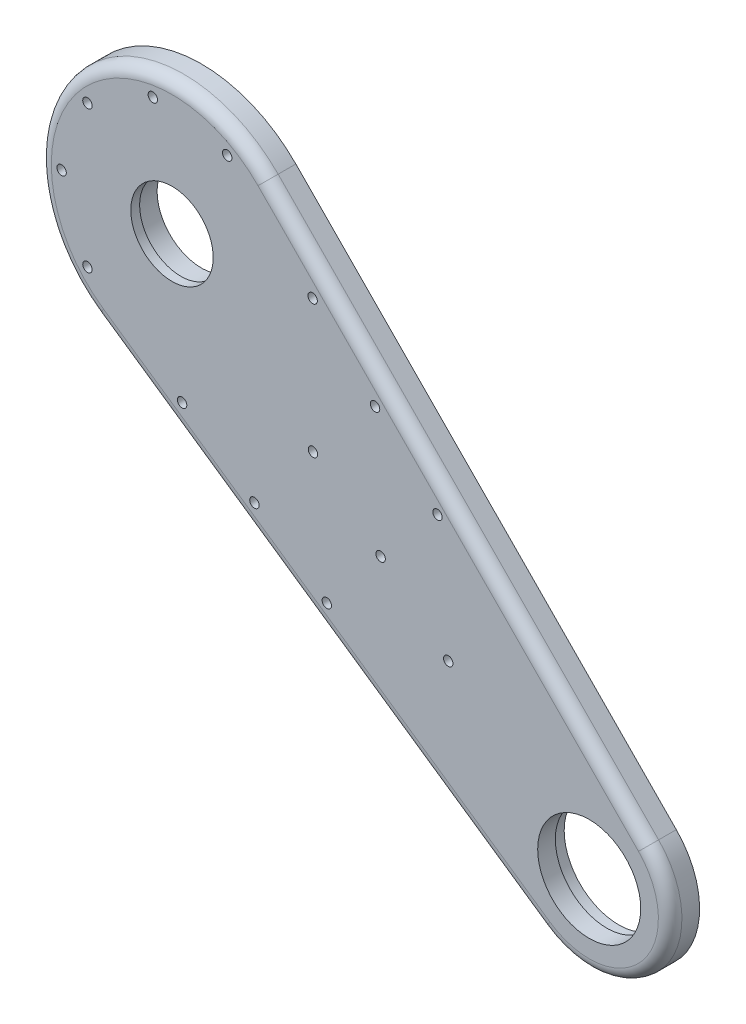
ISO-10303-21;
HEADER;
FILE_DESCRIPTION(('STEP AP214'),'2;1');
FILE_NAME('part.step','',(''),(''),'','','');
FILE_SCHEMA(('AUTOMOTIVE_DESIGN { 1 0 10303 214 1 1 1 1 }'));
ENDSEC;
DATA;
#1=APPLICATION_CONTEXT('core data for automotive mechanical design processes');
#2=APPLICATION_PROTOCOL_DEFINITION('international standard','automotive_design',2000,#1);
#3=PRODUCT_CONTEXT('',#1,'mechanical');
#4=PRODUCT('Part','Part','',(#3));
#5=PRODUCT_RELATED_PRODUCT_CATEGORY('part','',(#4));
#6=PRODUCT_DEFINITION_FORMATION('','',#4);
#7=PRODUCT_DEFINITION_CONTEXT('part definition',#1,'design');
#8=PRODUCT_DEFINITION('design','',#6,#7);
#9=PRODUCT_DEFINITION_SHAPE('','',#8);
#10=(LENGTH_UNIT() NAMED_UNIT(*) SI_UNIT(.MILLI.,.METRE.));
#11=(NAMED_UNIT(*) PLANE_ANGLE_UNIT() SI_UNIT($,.RADIAN.));
#12=(NAMED_UNIT(*) SI_UNIT($,.STERADIAN.) SOLID_ANGLE_UNIT());
#13=UNCERTAINTY_MEASURE_WITH_UNIT(LENGTH_MEASURE(1.E-05),#10,'distance_accuracy_value','');
#14=(GEOMETRIC_REPRESENTATION_CONTEXT(3) GLOBAL_UNCERTAINTY_ASSIGNED_CONTEXT((#13)) GLOBAL_UNIT_ASSIGNED_CONTEXT((#10,
#11,#12)) REPRESENTATION_CONTEXT('',''));
#15=CARTESIAN_POINT('',(0.,0.,0.));
#16=DIRECTION('',(0.,0.,1.));
#17=DIRECTION('',(1.,0.,0.));
#18=AXIS2_PLACEMENT_3D('',#15,#16,#17);
#19=CARTESIAN_POINT('',(0.,0.,47.));
#20=DIRECTION('',(0.,0.,-1.));
#21=DIRECTION('',(-1.,0.,0.));
#22=AXIS2_PLACEMENT_3D('',#19,#20,#21);
#23=CYLINDRICAL_SURFACE('',#22,14.);
#24=CARTESIAN_POINT('',(0.,0.,47.));
#25=DIRECTION('',(0.,0.,-1.));
#26=DIRECTION('',(-1.,0.,0.));
#27=AXIS2_PLACEMENT_3D('',#24,#25,#26);
#28=CIRCLE('',#27,14.);
#29=CARTESIAN_POINT('',(-14.,0.,47.));
#30=VERTEX_POINT('',#29);
#31=EDGE_CURVE('E168',#30,#30,#28,.T.);
#32=ORIENTED_EDGE('',*,*,#31,.F.);
#33=EDGE_LOOP('',(#32));
#34=FACE_BOUND('',#33,.T.);
#35=CARTESIAN_POINT('',(0.,0.,44.));
#36=DIRECTION('',(0.,0.,-1.));
#37=DIRECTION('',(-1.,0.,0.));
#38=AXIS2_PLACEMENT_3D('',#35,#36,#37);
#39=CIRCLE('',#38,14.);
#40=CARTESIAN_POINT('',(-14.,0.,44.));
#41=VERTEX_POINT('',#40);
#42=EDGE_CURVE('E159',#41,#41,#39,.T.);
#43=ORIENTED_EDGE('',*,*,#42,.T.);
#44=EDGE_LOOP('',(#43));
#45=FACE_BOUND('',#44,.T.);
#46=ADVANCED_FACE('F39',(#34,#45),#23,.F.);
#47=CARTESIAN_POINT('',(141.718221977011,-118.91570779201,47.));
#48=DIRECTION('',(0.,0.,-1.));
#49=DIRECTION('',(-1.,0.,0.));
#50=AXIS2_PLACEMENT_3D('',#47,#48,#49);
#51=CYLINDRICAL_SURFACE('',#50,17.5);
#52=CARTESIAN_POINT('',(141.718221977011,-118.91570779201,47.));
#53=DIRECTION('',(0.,0.,1.));
#54=DIRECTION('',(1.,0.,0.));
#55=AXIS2_PLACEMENT_3D('',#52,#53,#54);
#56=CIRCLE('',#55,17.5);
#57=CARTESIAN_POINT('',(159.218221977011,-118.91570779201,47.));
#58=VERTEX_POINT('',#57);
#59=EDGE_CURVE('E245',#58,#58,#56,.T.);
#60=ORIENTED_EDGE('',*,*,#59,.T.);
#61=EDGE_LOOP('',(#60));
#62=FACE_BOUND('',#61,.T.);
#63=CARTESIAN_POINT('',(141.718221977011,-118.91570779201,41.));
#64=DIRECTION('',(0.,0.,-1.));
#65=DIRECTION('',(-1.,0.,0.));
#66=AXIS2_PLACEMENT_3D('',#63,#64,#65);
#67=CIRCLE('',#66,17.5);
#68=CARTESIAN_POINT('',(124.218221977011,-118.91570779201,41.));
#69=VERTEX_POINT('',#68);
#70=EDGE_CURVE('E126',#69,#69,#67,.T.);
#71=ORIENTED_EDGE('',*,*,#70,.T.);
#72=EDGE_LOOP('',(#71));
#73=FACE_BOUND('',#72,.T.);
#74=ADVANCED_FACE('F277',(#62,#73),#51,.F.);
#75=CARTESIAN_POINT('',(0.,0.,47.));
#76=DIRECTION('',(0.,0.,1.));
#77=DIRECTION('',(1.,0.,0.));
#78=AXIS2_PLACEMENT_3D('',#75,#76,#77);
#79=PLANE('',#78);
#80=DIRECTION('',(0.823413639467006,-0.567441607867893,0.));
#81=VECTOR('',#80,1.);
#82=CARTESIAN_POINT('',(128.383344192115,-138.265928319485,47.));
#83=LINE('',#82,#81);
#84=CARTESIAN_POINT('',(-23.2651059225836,-33.7599592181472,47.));
#85=VERTEX_POINT('',#84);
#86=CARTESIAN_POINT('',(128.383344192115,-138.265928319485,47.));
#87=VERTEX_POINT('',#86);
#88=EDGE_CURVE('E134',#85,#87,#83,.T.);
#89=ORIENTED_EDGE('',*,*,#88,.T.);
#90=CARTESIAN_POINT('',(141.718221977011,-118.91570779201,47.));
#91=DIRECTION('',(0.,0.,1.));
#92=DIRECTION('',(1.,0.,0.));
#93=AXIS2_PLACEMENT_3D('',#90,#91,#92);
#94=CIRCLE('',#93,23.5);
#95=CARTESIAN_POINT('',(158.458891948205,-102.423286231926,47.));
#96=VERTEX_POINT('',#95);
#97=EDGE_CURVE('E136',#87,#96,#94,.T.);
#98=ORIENTED_EDGE('',*,*,#97,.T.);
#99=DIRECTION('',(-0.701805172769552,0.712368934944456,0.));
#100=VECTOR('',#99,1.);
#101=CARTESIAN_POINT('',(29.2071263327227,28.7740120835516,47.));
#102=LINE('',#101,#100);
#103=CARTESIAN_POINT('',(29.2071263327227,28.7740120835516,47.));
#104=VERTEX_POINT('',#103);
#105=EDGE_CURVE('E97',#96,#104,#102,.T.);
#106=ORIENTED_EDGE('',*,*,#105,.T.);
#107=CARTESIAN_POINT('',(0.,0.,47.));
#108=DIRECTION('',(0.,0.,1.));
#109=DIRECTION('',(1.,0.,0.));
#110=AXIS2_PLACEMENT_3D('',#107,#108,#109);
#111=CIRCLE('',#110,41.);
#112=EDGE_CURVE('E132',#104,#85,#111,.T.);
#113=ORIENTED_EDGE('',*,*,#112,.T.);
#114=EDGE_LOOP('',(#89,#98,#106,#113));
#115=FACE_BOUND('',#114,.T.);
#116=ORIENTED_EDGE('',*,*,#31,.T.);
#117=EDGE_LOOP('',(#116));
#118=FACE_BOUND('',#117,.T.);
#119=CARTESIAN_POINT('',(18.75,32.4759526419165,47.));
#120=DIRECTION('',(0.,0.,-1.));
#121=DIRECTION('',(-1.,0.,0.));
#122=AXIS2_PLACEMENT_3D('',#119,#120,#121);
#123=CIRCLE('',#122,1.6);
#124=CARTESIAN_POINT('',(17.15,32.4759526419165,47.));
#125=VERTEX_POINT('',#124);
#126=EDGE_CURVE('E172',#125,#125,#123,.T.);
#127=ORIENTED_EDGE('',*,*,#126,.T.);
#128=EDGE_LOOP('',(#127));
#129=FACE_BOUND('',#128,.T.);
#130=CARTESIAN_POINT('',(-6.51180666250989,36.9302907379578,47.));
#131=DIRECTION('',(0.,0.,-1.));
#132=DIRECTION('',(-1.,0.,0.));
#133=AXIS2_PLACEMENT_3D('',#130,#131,#132);
#134=CIRCLE('',#133,1.6);
#135=CARTESIAN_POINT('',(-8.11180666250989,36.9302907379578,47.));
#136=VERTEX_POINT('',#135);
#137=EDGE_CURVE('E182',#136,#136,#134,.T.);
#138=ORIENTED_EDGE('',*,*,#137,.T.);
#139=EDGE_LOOP('',(#138));
#140=FACE_BOUND('',#139,.T.);
#141=CARTESIAN_POINT('',(-28.7266666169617,24.1045353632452,47.));
#142=DIRECTION('',(0.,0.,-1.));
#143=DIRECTION('',(-1.,0.,0.));
#144=AXIS2_PLACEMENT_3D('',#141,#142,#143);
#145=CIRCLE('',#144,1.6);
#146=CARTESIAN_POINT('',(-30.3266666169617,24.1045353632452,47.));
#147=VERTEX_POINT('',#146);
#148=EDGE_CURVE('E188',#147,#147,#145,.T.);
#149=ORIENTED_EDGE('',*,*,#148,.T.);
#150=EDGE_LOOP('',(#149));
#151=FACE_BOUND('',#150,.T.);
#152=CARTESIAN_POINT('',(-37.5,0.,47.));
#153=DIRECTION('',(0.,0.,-1.));
#154=DIRECTION('',(-1.,0.,0.));
#155=AXIS2_PLACEMENT_3D('',#152,#153,#154);
#156=CIRCLE('',#155,1.6);
#157=CARTESIAN_POINT('',(-39.1,0.,47.));
#158=VERTEX_POINT('',#157);
#159=EDGE_CURVE('E194',#158,#158,#156,.T.);
#160=ORIENTED_EDGE('',*,*,#159,.T.);
#161=EDGE_LOOP('',(#160));
#162=FACE_BOUND('',#161,.T.);
#163=CARTESIAN_POINT('',(-28.7266666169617,-24.1045353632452,47.));
#164=DIRECTION('',(0.,0.,-1.));
#165=DIRECTION('',(-1.,0.,0.));
#166=AXIS2_PLACEMENT_3D('',#163,#164,#165);
#167=CIRCLE('',#166,1.6);
#168=CARTESIAN_POINT('',(-30.3266666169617,-24.1045353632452,47.));
#169=VERTEX_POINT('',#168);
#170=EDGE_CURVE('E171',#169,#169,#167,.T.);
#171=ORIENTED_EDGE('',*,*,#170,.T.);
#172=EDGE_LOOP('',(#171));
#173=FACE_BOUND('',#172,.T.);
#174=CARTESIAN_POINT('',(90.1797329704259,-37.4944400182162,47.));
#175=DIRECTION('',(0.,0.,1.));
#176=DIRECTION('',(1.,0.,0.));
#177=AXIS2_PLACEMENT_3D('',#174,#175,#176);
#178=CIRCLE('',#177,1.59999999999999);
#179=CARTESIAN_POINT('',(91.7797329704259,-37.4944400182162,47.));
#180=VERTEX_POINT('',#179);
#181=EDGE_CURVE('E212',#180,#180,#178,.T.);
#182=ORIENTED_EDGE('',*,*,#181,.F.);
#183=EDGE_LOOP('',(#182));
#184=FACE_BOUND('',#183,.T.);
#185=CARTESIAN_POINT('',(28.0038552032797,-65.1000593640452,47.));
#186=DIRECTION('',(0.,0.,1.));
#187=DIRECTION('',(1.,0.,0.));
#188=AXIS2_PLACEMENT_3D('',#185,#186,#187);
#189=CIRCLE('',#188,1.60000000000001);
#190=CARTESIAN_POINT('',(29.6038552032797,-65.1000593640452,47.));
#191=VERTEX_POINT('',#190);
#192=EDGE_CURVE('E224',#191,#191,#189,.T.);
#193=ORIENTED_EDGE('',*,*,#192,.F.);
#194=EDGE_LOOP('',(#193));
#195=FACE_BOUND('',#194,.T.);
#196=CARTESIAN_POINT('',(47.7679902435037,4.94662593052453,47.));
#197=DIRECTION('',(0.,0.,1.));
#198=DIRECTION('',(1.,0.,0.));
#199=AXIS2_PLACEMENT_3D('',#196,#197,#198);
#200=CIRCLE('',#199,1.6);
#201=CARTESIAN_POINT('',(49.3679902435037,4.94662593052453,47.));
#202=VERTEX_POINT('',#201);
#203=EDGE_CURVE('E236',#202,#202,#200,.T.);
#204=ORIENTED_EDGE('',*,*,#203,.F.);
#205=EDGE_LOOP('',(#204));
#206=FACE_BOUND('',#205,.T.);
#207=ORIENTED_EDGE('',*,*,#59,.F.);
#208=EDGE_LOOP('',(#207));
#209=FACE_BOUND('',#208,.T.);
#210=CARTESIAN_POINT('',(70.8591109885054,-59.457853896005,47.));
#211=DIRECTION('',(0.,0.,1.));
#212=DIRECTION('',(1.,0.,0.));
#213=AXIS2_PLACEMENT_3D('',#210,#211,#212);
#214=CIRCLE('',#213,1.60000000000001);
#215=CARTESIAN_POINT('',(72.4591109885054,-59.457853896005,47.));
#216=VERTEX_POINT('',#215);
#217=EDGE_CURVE('E112',#216,#216,#214,.T.);
#218=ORIENTED_EDGE('',*,*,#217,.F.);
#219=EDGE_LOOP('',(#218));
#220=FACE_BOUND('',#219,.T.);
#221=CARTESIAN_POINT('',(47.8777776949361,-40.1742256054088,47.));
#222=DIRECTION('',(0.,0.,1.));
#223=DIRECTION('',(1.,0.,0.));
#224=AXIS2_PLACEMENT_3D('',#221,#222,#223);
#225=CIRCLE('',#224,1.6);
#226=CARTESIAN_POINT('',(49.4777776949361,-40.1742256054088,47.));
#227=VERTEX_POINT('',#226);
#228=EDGE_CURVE('E251',#227,#227,#225,.T.);
#229=ORIENTED_EDGE('',*,*,#228,.F.);
#230=EDGE_LOOP('',(#229));
#231=FACE_BOUND('',#230,.T.);
#232=CARTESIAN_POINT('',(93.8404442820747,-78.7414821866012,47.));
#233=DIRECTION('',(0.,0.,1.));
#234=DIRECTION('',(1.,0.,0.));
#235=AXIS2_PLACEMENT_3D('',#232,#233,#234);
#236=CIRCLE('',#235,1.60000000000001);
#237=CARTESIAN_POINT('',(95.4404442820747,-78.7414821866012,47.));
#238=VERTEX_POINT('',#237);
#239=EDGE_CURVE('E242',#238,#238,#236,.T.);
#240=ORIENTED_EDGE('',*,*,#239,.F.);
#241=EDGE_LOOP('',(#240));
#242=FACE_BOUND('',#241,.T.);
#243=CARTESIAN_POINT('',(3.4233488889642,-47.9012597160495,47.));
#244=DIRECTION('',(0.,0.,1.));
#245=DIRECTION('',(1.,0.,0.));
#246=AXIS2_PLACEMENT_3D('',#243,#244,#245);
#247=CIRCLE('',#246,1.6);
#248=CARTESIAN_POINT('',(5.0233488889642,-47.9012597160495,47.));
#249=VERTEX_POINT('',#248);
#250=EDGE_CURVE('E230',#249,#249,#247,.T.);
#251=ORIENTED_EDGE('',*,*,#250,.F.);
#252=EDGE_LOOP('',(#251));
#253=FACE_BOUND('',#252,.T.);
#254=CARTESIAN_POINT('',(68.9738616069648,-16.2739070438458,47.));
#255=DIRECTION('',(0.,0.,1.));
#256=DIRECTION('',(1.,0.,0.));
#257=AXIS2_PLACEMENT_3D('',#254,#255,#256);
#258=CIRCLE('',#257,1.6);
#259=CARTESIAN_POINT('',(70.5738616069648,-16.2739070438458,47.));
#260=VERTEX_POINT('',#259);
#261=EDGE_CURVE('E218',#260,#260,#258,.T.);
#262=ORIENTED_EDGE('',*,*,#261,.F.);
#263=EDGE_LOOP('',(#262));
#264=FACE_BOUND('',#263,.T.);
#265=CARTESIAN_POINT('',(52.5843615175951,-82.298859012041,47.));
#266=DIRECTION('',(0.,0.,1.));
#267=DIRECTION('',(1.,0.,0.));
#268=AXIS2_PLACEMENT_3D('',#265,#266,#267);
#269=CIRCLE('',#268,1.60000000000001);
#270=CARTESIAN_POINT('',(54.1843615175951,-82.298859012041,47.));
#271=VERTEX_POINT('',#270);
#272=EDGE_CURVE('E206',#271,#271,#269,.T.);
#273=ORIENTED_EDGE('',*,*,#272,.F.);
#274=EDGE_LOOP('',(#273));
#275=FACE_BOUND('',#274,.T.);
#276=ADVANCED_FACE('F285',(#115,#118,#129,#140,#151,#162,#173,#184,#195,#206,#209,#220,#231,
#242,#253,#264,#275),#79,.T.);
#277=CARTESIAN_POINT('',(0.,0.,37.));
#278=DIRECTION('',(0.,0.,1.));
#279=DIRECTION('',(1.,0.,0.));
#280=AXIS2_PLACEMENT_3D('',#277,#278,#279);
#281=PLANE('',#280);
#282=CARTESIAN_POINT('',(0.,0.,37.));
#283=DIRECTION('',(0.,0.,-1.));
#284=DIRECTION('',(-1.,0.,0.));
#285=AXIS2_PLACEMENT_3D('',#282,#283,#284);
#286=CIRCLE('',#285,15.0625);
#287=CARTESIAN_POINT('',(-15.0625,0.,37.));
#288=VERTEX_POINT('',#287);
#289=EDGE_CURVE('E154',#288,#288,#286,.T.);
#290=ORIENTED_EDGE('',*,*,#289,.F.);
#291=EDGE_LOOP('',(#290));
#292=FACE_BOUND('',#291,.T.);
#293=CARTESIAN_POINT('',(18.75,32.4759526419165,37.));
#294=DIRECTION('',(0.,0.,-1.));
#295=DIRECTION('',(-1.,0.,0.));
#296=AXIS2_PLACEMENT_3D('',#293,#294,#295);
#297=CIRCLE('',#296,1.6);
#298=CARTESIAN_POINT('',(17.15,32.4759526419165,37.));
#299=VERTEX_POINT('',#298);
#300=EDGE_CURVE('E176',#299,#299,#297,.T.);
#301=ORIENTED_EDGE('',*,*,#300,.F.);
#302=EDGE_LOOP('',(#301));
#303=FACE_BOUND('',#302,.T.);
#304=CARTESIAN_POINT('',(-6.51180666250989,36.9302907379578,37.));
#305=DIRECTION('',(0.,0.,-1.));
#306=DIRECTION('',(-1.,0.,0.));
#307=AXIS2_PLACEMENT_3D('',#304,#305,#306);
#308=CIRCLE('',#307,1.6);
#309=CARTESIAN_POINT('',(-8.11180666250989,36.9302907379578,37.));
#310=VERTEX_POINT('',#309);
#311=EDGE_CURVE('E179',#310,#310,#308,.T.);
#312=ORIENTED_EDGE('',*,*,#311,.F.);
#313=EDGE_LOOP('',(#312));
#314=FACE_BOUND('',#313,.T.);
#315=CARTESIAN_POINT('',(-28.7266666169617,24.1045353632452,37.));
#316=DIRECTION('',(0.,0.,-1.));
#317=DIRECTION('',(-1.,0.,0.));
#318=AXIS2_PLACEMENT_3D('',#315,#316,#317);
#319=CIRCLE('',#318,1.6);
#320=CARTESIAN_POINT('',(-30.3266666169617,24.1045353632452,37.));
#321=VERTEX_POINT('',#320);
#322=EDGE_CURVE('E185',#321,#321,#319,.T.);
#323=ORIENTED_EDGE('',*,*,#322,.F.);
#324=EDGE_LOOP('',(#323));
#325=FACE_BOUND('',#324,.T.);
#326=CARTESIAN_POINT('',(-37.5,0.,37.));
#327=DIRECTION('',(0.,0.,-1.));
#328=DIRECTION('',(-1.,0.,0.));
#329=AXIS2_PLACEMENT_3D('',#326,#327,#328);
#330=CIRCLE('',#329,1.6);
#331=CARTESIAN_POINT('',(-39.1,0.,37.));
#332=VERTEX_POINT('',#331);
#333=EDGE_CURVE('E191',#332,#332,#330,.T.);
#334=ORIENTED_EDGE('',*,*,#333,.F.);
#335=EDGE_LOOP('',(#334));
#336=FACE_BOUND('',#335,.T.);
#337=CARTESIAN_POINT('',(-28.7266666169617,-24.1045353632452,37.));
#338=DIRECTION('',(0.,0.,-1.));
#339=DIRECTION('',(-1.,0.,0.));
#340=AXIS2_PLACEMENT_3D('',#337,#338,#339);
#341=CIRCLE('',#340,1.6);
#342=CARTESIAN_POINT('',(-30.3266666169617,-24.1045353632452,37.));
#343=VERTEX_POINT('',#342);
#344=EDGE_CURVE('E197',#343,#343,#341,.T.);
#345=ORIENTED_EDGE('',*,*,#344,.F.);
#346=EDGE_LOOP('',(#345));
#347=FACE_BOUND('',#346,.T.);
#348=CARTESIAN_POINT('',(141.718221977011,-118.91570779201,37.));
#349=DIRECTION('',(0.,0.,-1.));
#350=DIRECTION('',(-1.,0.,0.));
#351=AXIS2_PLACEMENT_3D('',#348,#349,#350);
#352=CIRCLE('',#351,18.5);
#353=CARTESIAN_POINT('',(123.218221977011,-118.91570779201,37.));
#354=VERTEX_POINT('',#353);
#355=EDGE_CURVE('E175',#354,#354,#352,.T.);
#356=ORIENTED_EDGE('',*,*,#355,.F.);
#357=EDGE_LOOP('',(#356));
#358=FACE_BOUND('',#357,.T.);
#359=CARTESIAN_POINT('',(0.,0.,37.));
#360=DIRECTION('',(0.,0.,1.));
#361=DIRECTION('',(1.,0.,0.));
#362=AXIS2_PLACEMENT_3D('',#359,#360,#361);
#363=CIRCLE('',#362,45.);
#364=CARTESIAN_POINT('',(32.0566020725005,31.5812327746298,37.));
#365=VERTEX_POINT('',#364);
#366=CARTESIAN_POINT('',(-25.5348723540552,-37.0536137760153,37.));
#367=VERTEX_POINT('',#366);
#368=EDGE_CURVE('E105',#365,#367,#363,.T.);
#369=ORIENTED_EDGE('',*,*,#368,.F.);
#370=DIRECTION('',(-0.701805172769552,0.712368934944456,0.));
#371=VECTOR('',#370,1.);
#372=CARTESIAN_POINT('',(32.0566020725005,31.5812327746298,37.));
#373=LINE('',#372,#371);
#374=CARTESIAN_POINT('',(161.308367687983,-99.6160655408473,37.));
#375=VERTEX_POINT('',#374);
#376=EDGE_CURVE('E120',#375,#365,#373,.T.);
#377=ORIENTED_EDGE('',*,*,#376,.F.);
#378=CARTESIAN_POINT('',(141.718221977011,-118.91570779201,37.));
#379=DIRECTION('',(0.,0.,1.));
#380=DIRECTION('',(1.,0.,0.));
#381=AXIS2_PLACEMENT_3D('',#378,#379,#380);
#382=CIRCLE('',#381,27.5);
#383=CARTESIAN_POINT('',(126.113577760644,-141.559582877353,37.));
#384=VERTEX_POINT('',#383);
#385=EDGE_CURVE('E107',#384,#375,#382,.T.);
#386=ORIENTED_EDGE('',*,*,#385,.F.);
#387=DIRECTION('',(0.823413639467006,-0.567441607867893,0.));
#388=VECTOR('',#387,1.);
#389=CARTESIAN_POINT('',(-25.5348723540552,-37.0536137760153,37.));
#390=LINE('',#389,#388);
#391=EDGE_CURVE('E94',#367,#384,#390,.T.);
#392=ORIENTED_EDGE('',*,*,#391,.F.);
#393=EDGE_LOOP('',(#369,#377,#386,#392));
#394=FACE_BOUND('',#393,.T.);
#395=CARTESIAN_POINT('',(70.8591109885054,-59.457853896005,37.));
#396=DIRECTION('',(0.,0.,1.));
#397=DIRECTION('',(1.,0.,0.));
#398=AXIS2_PLACEMENT_3D('',#395,#396,#397);
#399=CIRCLE('',#398,1.60000000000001);
#400=CARTESIAN_POINT('',(72.4591109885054,-59.457853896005,37.));
#401=VERTEX_POINT('',#400);
#402=EDGE_CURVE('E115',#401,#401,#399,.T.);
#403=ORIENTED_EDGE('',*,*,#402,.T.);
#404=EDGE_LOOP('',(#403));
#405=FACE_BOUND('',#404,.T.);
#406=CARTESIAN_POINT('',(47.8777776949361,-40.1742256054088,37.));
#407=DIRECTION('',(0.,0.,1.));
#408=DIRECTION('',(1.,0.,0.));
#409=AXIS2_PLACEMENT_3D('',#406,#407,#408);
#410=CIRCLE('',#409,1.6);
#411=CARTESIAN_POINT('',(49.4777776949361,-40.1742256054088,37.));
#412=VERTEX_POINT('',#411);
#413=EDGE_CURVE('E250',#412,#412,#410,.T.);
#414=ORIENTED_EDGE('',*,*,#413,.T.);
#415=EDGE_LOOP('',(#414));
#416=FACE_BOUND('',#415,.T.);
#417=CARTESIAN_POINT('',(93.8404442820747,-78.7414821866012,37.));
#418=DIRECTION('',(0.,0.,1.));
#419=DIRECTION('',(1.,0.,0.));
#420=AXIS2_PLACEMENT_3D('',#417,#418,#419);
#421=CIRCLE('',#420,1.60000000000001);
#422=CARTESIAN_POINT('',(95.4404442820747,-78.7414821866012,37.));
#423=VERTEX_POINT('',#422);
#424=EDGE_CURVE('E239',#423,#423,#421,.T.);
#425=ORIENTED_EDGE('',*,*,#424,.T.);
#426=EDGE_LOOP('',(#425));
#427=FACE_BOUND('',#426,.T.);
#428=CARTESIAN_POINT('',(47.7679902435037,4.94662593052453,37.));
#429=DIRECTION('',(0.,0.,1.));
#430=DIRECTION('',(1.,0.,0.));
#431=AXIS2_PLACEMENT_3D('',#428,#429,#430);
#432=CIRCLE('',#431,1.6);
#433=CARTESIAN_POINT('',(49.3679902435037,4.94662593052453,37.));
#434=VERTEX_POINT('',#433);
#435=EDGE_CURVE('E233',#434,#434,#432,.T.);
#436=ORIENTED_EDGE('',*,*,#435,.T.);
#437=EDGE_LOOP('',(#436));
#438=FACE_BOUND('',#437,.T.);
#439=CARTESIAN_POINT('',(3.4233488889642,-47.9012597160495,37.));
#440=DIRECTION('',(0.,0.,1.));
#441=DIRECTION('',(1.,0.,0.));
#442=AXIS2_PLACEMENT_3D('',#439,#440,#441);
#443=CIRCLE('',#442,1.6);
#444=CARTESIAN_POINT('',(5.0233488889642,-47.9012597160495,37.));
#445=VERTEX_POINT('',#444);
#446=EDGE_CURVE('E227',#445,#445,#443,.T.);
#447=ORIENTED_EDGE('',*,*,#446,.T.);
#448=EDGE_LOOP('',(#447));
#449=FACE_BOUND('',#448,.T.);
#450=CARTESIAN_POINT('',(28.0038552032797,-65.1000593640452,37.));
#451=DIRECTION('',(0.,0.,1.));
#452=DIRECTION('',(1.,0.,0.));
#453=AXIS2_PLACEMENT_3D('',#450,#451,#452);
#454=CIRCLE('',#453,1.60000000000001);
#455=CARTESIAN_POINT('',(29.6038552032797,-65.1000593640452,37.));
#456=VERTEX_POINT('',#455);
#457=EDGE_CURVE('E221',#456,#456,#454,.T.);
#458=ORIENTED_EDGE('',*,*,#457,.T.);
#459=EDGE_LOOP('',(#458));
#460=FACE_BOUND('',#459,.T.);
#461=CARTESIAN_POINT('',(68.9738616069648,-16.2739070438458,37.));
#462=DIRECTION('',(0.,0.,1.));
#463=DIRECTION('',(1.,0.,0.));
#464=AXIS2_PLACEMENT_3D('',#461,#462,#463);
#465=CIRCLE('',#464,1.6);
#466=CARTESIAN_POINT('',(70.5738616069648,-16.2739070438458,37.));
#467=VERTEX_POINT('',#466);
#468=EDGE_CURVE('E215',#467,#467,#465,.T.);
#469=ORIENTED_EDGE('',*,*,#468,.T.);
#470=EDGE_LOOP('',(#469));
#471=FACE_BOUND('',#470,.T.);
#472=CARTESIAN_POINT('',(90.1797329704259,-37.4944400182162,37.));
#473=DIRECTION('',(0.,0.,1.));
#474=DIRECTION('',(1.,0.,0.));
#475=AXIS2_PLACEMENT_3D('',#472,#473,#474);
#476=CIRCLE('',#475,1.59999999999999);
#477=CARTESIAN_POINT('',(91.7797329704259,-37.4944400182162,37.));
#478=VERTEX_POINT('',#477);
#479=EDGE_CURVE('E209',#478,#478,#476,.T.);
#480=ORIENTED_EDGE('',*,*,#479,.T.);
#481=EDGE_LOOP('',(#480));
#482=FACE_BOUND('',#481,.T.);
#483=CARTESIAN_POINT('',(52.5843615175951,-82.298859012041,37.));
#484=DIRECTION('',(0.,0.,1.));
#485=DIRECTION('',(1.,0.,0.));
#486=AXIS2_PLACEMENT_3D('',#483,#484,#485);
#487=CIRCLE('',#486,1.60000000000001);
#488=CARTESIAN_POINT('',(54.1843615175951,-82.298859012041,37.));
#489=VERTEX_POINT('',#488);
#490=EDGE_CURVE('E129',#489,#489,#487,.T.);
#491=ORIENTED_EDGE('',*,*,#490,.T.);
#492=EDGE_LOOP('',(#491));
#493=FACE_BOUND('',#492,.T.);
#494=ADVANCED_FACE('F102',(#292,#303,#314,#325,#336,#347,#358,#394,#405,#416,#427,#438,#449,
#460,#471,#482,#493),#281,.F.);
#495=CARTESIAN_POINT('',(0.,0.,47.));
#496=DIRECTION('',(0.,0.,-1.));
#497=DIRECTION('',(-1.,0.,0.));
#498=AXIS2_PLACEMENT_3D('',#495,#496,#497);
#499=CYLINDRICAL_SURFACE('',#498,45.);
#500=DIRECTION('',(0.,0.,-1.));
#501=VECTOR('',#500,1.);
#502=CARTESIAN_POINT('',(-25.5348723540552,-37.0536137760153,47.));
#503=LINE('',#502,#501);
#504=CARTESIAN_POINT('',(-25.5348723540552,-37.0536137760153,43.));
#505=VERTEX_POINT('',#504);
#506=EDGE_CURVE('E91',#505,#367,#503,.T.);
#507=ORIENTED_EDGE('',*,*,#506,.F.);
#508=CARTESIAN_POINT('',(0.,0.,43.));
#509=DIRECTION('',(0.,0.,1.));
#510=DIRECTION('',(1.,0.,0.));
#511=AXIS2_PLACEMENT_3D('',#508,#509,#510);
#512=CIRCLE('',#511,45.);
#513=CARTESIAN_POINT('',(32.0566020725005,31.5812327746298,43.));
#514=VERTEX_POINT('',#513);
#515=EDGE_CURVE('E48',#505,#514,#512,.F.);
#516=ORIENTED_EDGE('',*,*,#515,.T.);
#517=DIRECTION('',(0.,0.,-1.));
#518=VECTOR('',#517,1.);
#519=CARTESIAN_POINT('',(32.0566020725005,31.5812327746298,47.));
#520=LINE('',#519,#518);
#521=EDGE_CURVE('E110',#514,#365,#520,.T.);
#522=ORIENTED_EDGE('',*,*,#521,.T.);
#523=ORIENTED_EDGE('',*,*,#368,.T.);
#524=EDGE_LOOP('',(#507,#516,#522,#523));
#525=FACE_BOUND('',#524,.T.);
#526=ADVANCED_FACE('F109',(#525),#499,.T.);
#527=CARTESIAN_POINT('',(-25.5348723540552,-37.0536137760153,47.));
#528=DIRECTION('',(0.567441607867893,0.823413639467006,0.));
#529=DIRECTION('',(-0.823413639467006,0.567441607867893,0.));
#530=AXIS2_PLACEMENT_3D('',#527,#528,#529);
#531=PLANE('',#530);
#532=DIRECTION('',(0.,0.,-1.));
#533=VECTOR('',#532,1.);
#534=CARTESIAN_POINT('',(126.113577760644,-141.559582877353,47.));
#535=LINE('',#534,#533);
#536=CARTESIAN_POINT('',(126.113577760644,-141.559582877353,43.));
#537=VERTEX_POINT('',#536);
#538=EDGE_CURVE('E98',#537,#384,#535,.T.);
#539=ORIENTED_EDGE('',*,*,#538,.F.);
#540=DIRECTION('',(0.823413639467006,-0.567441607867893,0.));
#541=VECTOR('',#540,1.);
#542=CARTESIAN_POINT('',(-25.5348723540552,-37.0536137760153,43.));
#543=LINE('',#542,#541);
#544=EDGE_CURVE('E63',#537,#505,#543,.F.);
#545=ORIENTED_EDGE('',*,*,#544,.T.);
#546=ORIENTED_EDGE('',*,*,#506,.T.);
#547=ORIENTED_EDGE('',*,*,#391,.T.);
#548=EDGE_LOOP('',(#539,#545,#546,#547));
#549=FACE_BOUND('',#548,.T.);
#550=ADVANCED_FACE('F93',(#549),#531,.F.);
#551=CARTESIAN_POINT('',(141.718221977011,-118.91570779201,47.));
#552=DIRECTION('',(0.,0.,-1.));
#553=DIRECTION('',(-1.,0.,0.));
#554=AXIS2_PLACEMENT_3D('',#551,#552,#553);
#555=CYLINDRICAL_SURFACE('',#554,27.5);
#556=DIRECTION('',(0.,0.,-1.));
#557=VECTOR('',#556,1.);
#558=CARTESIAN_POINT('',(161.308367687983,-99.6160655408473,47.));
#559=LINE('',#558,#557);
#560=CARTESIAN_POINT('',(161.308367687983,-99.6160655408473,43.));
#561=VERTEX_POINT('',#560);
#562=EDGE_CURVE('E123',#561,#375,#559,.T.);
#563=ORIENTED_EDGE('',*,*,#562,.F.);
#564=CARTESIAN_POINT('',(141.718221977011,-118.91570779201,43.));
#565=DIRECTION('',(0.,0.,1.));
#566=DIRECTION('',(1.,0.,0.));
#567=AXIS2_PLACEMENT_3D('',#564,#565,#566);
#568=CIRCLE('',#567,27.5);
#569=EDGE_CURVE('E139',#561,#537,#568,.F.);
#570=ORIENTED_EDGE('',*,*,#569,.T.);
#571=ORIENTED_EDGE('',*,*,#538,.T.);
#572=ORIENTED_EDGE('',*,*,#385,.T.);
#573=EDGE_LOOP('',(#563,#570,#571,#572));
#574=FACE_BOUND('',#573,.T.);
#575=ADVANCED_FACE('F377',(#574),#555,.T.);
#576=CARTESIAN_POINT('',(32.0566020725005,31.5812327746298,47.));
#577=DIRECTION('',(-0.712368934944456,-0.701805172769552,0.));
#578=DIRECTION('',(0.701805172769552,-0.712368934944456,0.));
#579=AXIS2_PLACEMENT_3D('',#576,#577,#578);
#580=PLANE('',#579);
#581=ORIENTED_EDGE('',*,*,#521,.F.);
#582=DIRECTION('',(-0.701805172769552,0.712368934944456,0.));
#583=VECTOR('',#582,1.);
#584=CARTESIAN_POINT('',(161.308367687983,-99.6160655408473,43.));
#585=LINE('',#584,#583);
#586=EDGE_CURVE('E11',#514,#561,#585,.F.);
#587=ORIENTED_EDGE('',*,*,#586,.T.);
#588=ORIENTED_EDGE('',*,*,#562,.T.);
#589=ORIENTED_EDGE('',*,*,#376,.T.);
#590=EDGE_LOOP('',(#581,#587,#588,#589));
#591=FACE_BOUND('',#590,.T.);
#592=ADVANCED_FACE('F272',(#591),#580,.F.);
#593=CARTESIAN_POINT('',(70.8591109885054,-59.457853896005,47.));
#594=DIRECTION('',(0.,0.,-1.));
#595=DIRECTION('',(-1.,0.,0.));
#596=AXIS2_PLACEMENT_3D('',#593,#594,#595);
#597=CYLINDRICAL_SURFACE('',#596,1.60000000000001);
#598=ORIENTED_EDGE('',*,*,#217,.T.);
#599=EDGE_LOOP('',(#598));
#600=FACE_BOUND('',#599,.T.);
#601=ORIENTED_EDGE('',*,*,#402,.F.);
#602=EDGE_LOOP('',(#601));
#603=FACE_BOUND('',#602,.T.);
#604=ADVANCED_FACE('F262',(#600,#603),#597,.F.);
#605=CARTESIAN_POINT('',(47.8777776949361,-40.1742256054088,47.));
#606=DIRECTION('',(0.,0.,-1.));
#607=DIRECTION('',(-1.,0.,0.));
#608=AXIS2_PLACEMENT_3D('',#605,#606,#607);
#609=CYLINDRICAL_SURFACE('',#608,1.6);
#610=ORIENTED_EDGE('',*,*,#228,.T.);
#611=EDGE_LOOP('',(#610));
#612=FACE_BOUND('',#611,.T.);
#613=ORIENTED_EDGE('',*,*,#413,.F.);
#614=EDGE_LOOP('',(#613));
#615=FACE_BOUND('',#614,.T.);
#616=ADVANCED_FACE('F259',(#612,#615),#609,.F.);
#617=CARTESIAN_POINT('',(93.8404442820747,-78.7414821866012,47.));
#618=DIRECTION('',(0.,0.,-1.));
#619=DIRECTION('',(-1.,0.,0.));
#620=AXIS2_PLACEMENT_3D('',#617,#618,#619);
#621=CYLINDRICAL_SURFACE('',#620,1.60000000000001);
#622=ORIENTED_EDGE('',*,*,#239,.T.);
#623=EDGE_LOOP('',(#622));
#624=FACE_BOUND('',#623,.T.);
#625=ORIENTED_EDGE('',*,*,#424,.F.);
#626=EDGE_LOOP('',(#625));
#627=FACE_BOUND('',#626,.T.);
#628=ADVANCED_FACE('F261',(#624,#627),#621,.F.);
#629=CARTESIAN_POINT('',(47.7679902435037,4.94662593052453,47.));
#630=DIRECTION('',(0.,0.,-1.));
#631=DIRECTION('',(-1.,0.,0.));
#632=AXIS2_PLACEMENT_3D('',#629,#630,#631);
#633=CYLINDRICAL_SURFACE('',#632,1.6);
#634=ORIENTED_EDGE('',*,*,#203,.T.);
#635=EDGE_LOOP('',(#634));
#636=FACE_BOUND('',#635,.T.);
#637=ORIENTED_EDGE('',*,*,#435,.F.);
#638=EDGE_LOOP('',(#637));
#639=FACE_BOUND('',#638,.T.);
#640=ADVANCED_FACE('F269',(#636,#639),#633,.F.);
#641=CARTESIAN_POINT('',(3.4233488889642,-47.9012597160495,47.));
#642=DIRECTION('',(0.,0.,-1.));
#643=DIRECTION('',(-1.,0.,0.));
#644=AXIS2_PLACEMENT_3D('',#641,#642,#643);
#645=CYLINDRICAL_SURFACE('',#644,1.6);
#646=ORIENTED_EDGE('',*,*,#250,.T.);
#647=EDGE_LOOP('',(#646));
#648=FACE_BOUND('',#647,.T.);
#649=ORIENTED_EDGE('',*,*,#446,.F.);
#650=EDGE_LOOP('',(#649));
#651=FACE_BOUND('',#650,.T.);
#652=ADVANCED_FACE('F335',(#648,#651),#645,.F.);
#653=CARTESIAN_POINT('',(28.0038552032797,-65.1000593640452,47.));
#654=DIRECTION('',(0.,0.,-1.));
#655=DIRECTION('',(-1.,0.,0.));
#656=AXIS2_PLACEMENT_3D('',#653,#654,#655);
#657=CYLINDRICAL_SURFACE('',#656,1.60000000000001);
#658=ORIENTED_EDGE('',*,*,#192,.T.);
#659=EDGE_LOOP('',(#658));
#660=FACE_BOUND('',#659,.T.);
#661=ORIENTED_EDGE('',*,*,#457,.F.);
#662=EDGE_LOOP('',(#661));
#663=FACE_BOUND('',#662,.T.);
#664=ADVANCED_FACE('F331',(#660,#663),#657,.F.);
#665=CARTESIAN_POINT('',(68.9738616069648,-16.2739070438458,47.));
#666=DIRECTION('',(0.,0.,-1.));
#667=DIRECTION('',(-1.,0.,0.));
#668=AXIS2_PLACEMENT_3D('',#665,#666,#667);
#669=CYLINDRICAL_SURFACE('',#668,1.6);
#670=ORIENTED_EDGE('',*,*,#261,.T.);
#671=EDGE_LOOP('',(#670));
#672=FACE_BOUND('',#671,.T.);
#673=ORIENTED_EDGE('',*,*,#468,.F.);
#674=EDGE_LOOP('',(#673));
#675=FACE_BOUND('',#674,.T.);
#676=ADVANCED_FACE('F327',(#672,#675),#669,.F.);
#677=CARTESIAN_POINT('',(90.1797329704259,-37.4944400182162,47.));
#678=DIRECTION('',(0.,0.,-1.));
#679=DIRECTION('',(-1.,0.,0.));
#680=AXIS2_PLACEMENT_3D('',#677,#678,#679);
#681=CYLINDRICAL_SURFACE('',#680,1.59999999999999);
#682=ORIENTED_EDGE('',*,*,#181,.T.);
#683=EDGE_LOOP('',(#682));
#684=FACE_BOUND('',#683,.T.);
#685=ORIENTED_EDGE('',*,*,#479,.F.);
#686=EDGE_LOOP('',(#685));
#687=FACE_BOUND('',#686,.T.);
#688=ADVANCED_FACE('F323',(#684,#687),#681,.F.);
#689=CARTESIAN_POINT('',(52.5843615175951,-82.298859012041,47.));
#690=DIRECTION('',(0.,0.,-1.));
#691=DIRECTION('',(-1.,0.,0.));
#692=AXIS2_PLACEMENT_3D('',#689,#690,#691);
#693=CYLINDRICAL_SURFACE('',#692,1.60000000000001);
#694=ORIENTED_EDGE('',*,*,#272,.T.);
#695=EDGE_LOOP('',(#694));
#696=FACE_BOUND('',#695,.T.);
#697=ORIENTED_EDGE('',*,*,#490,.F.);
#698=EDGE_LOOP('',(#697));
#699=FACE_BOUND('',#698,.T.);
#700=ADVANCED_FACE('F319',(#696,#699),#693,.F.);
#701=CARTESIAN_POINT('',(141.718221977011,-118.91570779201,41.));
#702=DIRECTION('',(0.,0.,-1.));
#703=DIRECTION('',(-1.,0.,0.));
#704=AXIS2_PLACEMENT_3D('',#701,#702,#703);
#705=CYLINDRICAL_SURFACE('',#704,18.5);
#706=CARTESIAN_POINT('',(141.718221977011,-118.91570779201,41.));
#707=DIRECTION('',(0.,0.,-1.));
#708=DIRECTION('',(-1.,0.,0.));
#709=AXIS2_PLACEMENT_3D('',#706,#707,#708);
#710=CIRCLE('',#709,18.5);
#711=CARTESIAN_POINT('',(123.218221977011,-118.91570779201,41.));
#712=VERTEX_POINT('',#711);
#713=EDGE_CURVE('E130',#712,#712,#710,.T.);
#714=ORIENTED_EDGE('',*,*,#713,.F.);
#715=EDGE_LOOP('',(#714));
#716=FACE_BOUND('',#715,.T.);
#717=ORIENTED_EDGE('',*,*,#355,.T.);
#718=EDGE_LOOP('',(#717));
#719=FACE_BOUND('',#718,.T.);
#720=ADVANCED_FACE('F315',(#716,#719),#705,.F.);
#721=CARTESIAN_POINT('',(141.718221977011,-118.91570779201,41.));
#722=DIRECTION('',(0.,0.,-1.));
#723=DIRECTION('',(-1.,0.,0.));
#724=AXIS2_PLACEMENT_3D('',#721,#722,#723);
#725=PLANE('',#724);
#726=ORIENTED_EDGE('',*,*,#70,.F.);
#727=EDGE_LOOP('',(#726));
#728=FACE_BOUND('',#727,.T.);
#729=ORIENTED_EDGE('',*,*,#713,.T.);
#730=EDGE_LOOP('',(#729));
#731=FACE_BOUND('',#730,.T.);
#732=ADVANCED_FACE('F311',(#728,#731),#725,.T.);
#733=CARTESIAN_POINT('',(-28.7266666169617,-24.1045353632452,47.));
#734=DIRECTION('',(0.,0.,-1.));
#735=DIRECTION('',(-1.,0.,0.));
#736=AXIS2_PLACEMENT_3D('',#733,#734,#735);
#737=CYLINDRICAL_SURFACE('',#736,1.6);
#738=ORIENTED_EDGE('',*,*,#170,.F.);
#739=EDGE_LOOP('',(#738));
#740=FACE_BOUND('',#739,.T.);
#741=ORIENTED_EDGE('',*,*,#344,.T.);
#742=EDGE_LOOP('',(#741));
#743=FACE_BOUND('',#742,.T.);
#744=ADVANCED_FACE('F307',(#740,#743),#737,.F.);
#745=CARTESIAN_POINT('',(-37.5,0.,47.));
#746=DIRECTION('',(0.,0.,-1.));
#747=DIRECTION('',(-1.,0.,0.));
#748=AXIS2_PLACEMENT_3D('',#745,#746,#747);
#749=CYLINDRICAL_SURFACE('',#748,1.6);
#750=ORIENTED_EDGE('',*,*,#159,.F.);
#751=EDGE_LOOP('',(#750));
#752=FACE_BOUND('',#751,.T.);
#753=ORIENTED_EDGE('',*,*,#333,.T.);
#754=EDGE_LOOP('',(#753));
#755=FACE_BOUND('',#754,.T.);
#756=ADVANCED_FACE('F303',(#752,#755),#749,.F.);
#757=CARTESIAN_POINT('',(-28.7266666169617,24.1045353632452,47.));
#758=DIRECTION('',(0.,0.,-1.));
#759=DIRECTION('',(-1.,0.,0.));
#760=AXIS2_PLACEMENT_3D('',#757,#758,#759);
#761=CYLINDRICAL_SURFACE('',#760,1.6);
#762=ORIENTED_EDGE('',*,*,#148,.F.);
#763=EDGE_LOOP('',(#762));
#764=FACE_BOUND('',#763,.T.);
#765=ORIENTED_EDGE('',*,*,#322,.T.);
#766=EDGE_LOOP('',(#765));
#767=FACE_BOUND('',#766,.T.);
#768=ADVANCED_FACE('F299',(#764,#767),#761,.F.);
#769=CARTESIAN_POINT('',(-6.51180666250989,36.9302907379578,47.));
#770=DIRECTION('',(0.,0.,-1.));
#771=DIRECTION('',(-1.,0.,0.));
#772=AXIS2_PLACEMENT_3D('',#769,#770,#771);
#773=CYLINDRICAL_SURFACE('',#772,1.6);
#774=ORIENTED_EDGE('',*,*,#137,.F.);
#775=EDGE_LOOP('',(#774));
#776=FACE_BOUND('',#775,.T.);
#777=ORIENTED_EDGE('',*,*,#311,.T.);
#778=EDGE_LOOP('',(#777));
#779=FACE_BOUND('',#778,.T.);
#780=ADVANCED_FACE('F295',(#776,#779),#773,.F.);
#781=CARTESIAN_POINT('',(18.75,32.4759526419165,47.));
#782=DIRECTION('',(0.,0.,-1.));
#783=DIRECTION('',(-1.,0.,0.));
#784=AXIS2_PLACEMENT_3D('',#781,#782,#783);
#785=CYLINDRICAL_SURFACE('',#784,1.6);
#786=ORIENTED_EDGE('',*,*,#126,.F.);
#787=EDGE_LOOP('',(#786));
#788=FACE_BOUND('',#787,.T.);
#789=ORIENTED_EDGE('',*,*,#300,.T.);
#790=EDGE_LOOP('',(#789));
#791=FACE_BOUND('',#790,.T.);
#792=ADVANCED_FACE('F293',(#788,#791),#785,.F.);
#793=CARTESIAN_POINT('',(0.,0.,44.));
#794=DIRECTION('',(0.,0.,-1.));
#795=DIRECTION('',(-1.,0.,0.));
#796=AXIS2_PLACEMENT_3D('',#793,#794,#795);
#797=CYLINDRICAL_SURFACE('',#796,15.0625);
#798=CARTESIAN_POINT('',(0.,0.,44.));
#799=DIRECTION('',(0.,0.,-1.));
#800=DIRECTION('',(-1.,0.,0.));
#801=AXIS2_PLACEMENT_3D('',#798,#799,#800);
#802=CIRCLE('',#801,15.0625);
#803=CARTESIAN_POINT('',(-15.0625,0.,44.));
#804=VERTEX_POINT('',#803);
#805=EDGE_CURVE('E164',#804,#804,#802,.T.);
#806=ORIENTED_EDGE('',*,*,#805,.F.);
#807=EDGE_LOOP('',(#806));
#808=FACE_BOUND('',#807,.T.);
#809=ORIENTED_EDGE('',*,*,#289,.T.);
#810=EDGE_LOOP('',(#809));
#811=FACE_BOUND('',#810,.T.);
#812=ADVANCED_FACE('F291',(#808,#811),#797,.F.);
#813=CARTESIAN_POINT('',(0.,0.,44.));
#814=DIRECTION('',(0.,0.,-1.));
#815=DIRECTION('',(-1.,0.,0.));
#816=AXIS2_PLACEMENT_3D('',#813,#814,#815);
#817=PLANE('',#816);
#818=ORIENTED_EDGE('',*,*,#42,.F.);
#819=EDGE_LOOP('',(#818));
#820=FACE_BOUND('',#819,.T.);
#821=ORIENTED_EDGE('',*,*,#805,.T.);
#822=EDGE_LOOP('',(#821));
#823=FACE_BOUND('',#822,.T.);
#824=ADVANCED_FACE('F395',(#820,#823),#817,.T.);
#825=CARTESIAN_POINT('',(0.,0.,43.));
#826=DIRECTION('',(0.,0.,1.));
#827=DIRECTION('',(1.,0.,0.));
#828=AXIS2_PLACEMENT_3D('',#825,#826,#827);
#829=TOROIDAL_SURFACE('',#828,41.,4.);
#830=CARTESIAN_POINT('',(29.2071263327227,28.7740120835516,43.));
#831=DIRECTION('',(0.701805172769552,-0.712368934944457,0.));
#832=DIRECTION('',(0.712368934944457,0.701805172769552,0.));
#833=AXIS2_PLACEMENT_3D('',#830,#831,#832);
#834=CIRCLE('',#833,4.);
#835=EDGE_CURVE('E147',#514,#104,#834,.T.);
#836=ORIENTED_EDGE('',*,*,#835,.F.);
#837=ORIENTED_EDGE('',*,*,#515,.F.);
#838=CARTESIAN_POINT('',(-23.2651059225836,-33.7599592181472,43.));
#839=DIRECTION('',(0.823413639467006,-0.567441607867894,0.));
#840=DIRECTION('',(0.567441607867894,0.823413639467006,0.));
#841=AXIS2_PLACEMENT_3D('',#838,#839,#840);
#842=CIRCLE('',#841,4.);
#843=EDGE_CURVE('E43',#85,#505,#842,.T.);
#844=ORIENTED_EDGE('',*,*,#843,.F.);
#845=ORIENTED_EDGE('',*,*,#112,.F.);
#846=EDGE_LOOP('',(#836,#837,#844,#845));
#847=FACE_BOUND('',#846,.T.);
#848=ADVANCED_FACE('F41',(#847),#829,.T.);
#849=CARTESIAN_POINT('',(-23.2651059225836,-33.7599592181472,43.));
#850=DIRECTION('',(-0.823413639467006,0.567441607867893,0.));
#851=DIRECTION('',(-0.567441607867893,-0.823413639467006,0.));
#852=AXIS2_PLACEMENT_3D('',#849,#850,#851);
#853=CYLINDRICAL_SURFACE('',#852,4.);
#854=ORIENTED_EDGE('',*,*,#843,.T.);
#855=ORIENTED_EDGE('',*,*,#544,.F.);
#856=CARTESIAN_POINT('',(128.383344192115,-138.265928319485,43.));
#857=DIRECTION('',(0.823413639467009,-0.567441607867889,0.));
#858=DIRECTION('',(0.567441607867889,0.823413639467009,0.));
#859=AXIS2_PLACEMENT_3D('',#856,#857,#858);
#860=CIRCLE('',#859,4.);
#861=EDGE_CURVE('E146',#87,#537,#860,.T.);
#862=ORIENTED_EDGE('',*,*,#861,.F.);
#863=ORIENTED_EDGE('',*,*,#88,.F.);
#864=EDGE_LOOP('',(#854,#855,#862,#863));
#865=FACE_BOUND('',#864,.T.);
#866=ADVANCED_FACE('F390',(#865),#853,.T.);
#867=CARTESIAN_POINT('',(29.2071263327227,28.7740120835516,43.));
#868=DIRECTION('',(0.701805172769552,-0.712368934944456,0.));
#869=DIRECTION('',(0.712368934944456,0.701805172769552,0.));
#870=AXIS2_PLACEMENT_3D('',#867,#868,#869);
#871=CYLINDRICAL_SURFACE('',#870,4.);
#872=ORIENTED_EDGE('',*,*,#835,.T.);
#873=ORIENTED_EDGE('',*,*,#105,.F.);
#874=CARTESIAN_POINT('',(158.458891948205,-102.423286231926,43.));
#875=DIRECTION('',(0.701805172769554,-0.712368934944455,0.));
#876=DIRECTION('',(0.712368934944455,0.701805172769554,0.));
#877=AXIS2_PLACEMENT_3D('',#874,#875,#876);
#878=CIRCLE('',#877,4.);
#879=EDGE_CURVE('E144',#561,#96,#878,.T.);
#880=ORIENTED_EDGE('',*,*,#879,.F.);
#881=ORIENTED_EDGE('',*,*,#586,.F.);
#882=EDGE_LOOP('',(#872,#873,#880,#881));
#883=FACE_BOUND('',#882,.T.);
#884=ADVANCED_FACE('F387',(#883),#871,.T.);
#885=CARTESIAN_POINT('',(141.718221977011,-118.91570779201,43.));
#886=DIRECTION('',(0.,0.,1.));
#887=DIRECTION('',(1.,0.,0.));
#888=AXIS2_PLACEMENT_3D('',#885,#886,#887);
#889=TOROIDAL_SURFACE('',#888,23.5,4.);
#890=ORIENTED_EDGE('',*,*,#861,.T.);
#891=ORIENTED_EDGE('',*,*,#569,.F.);
#892=ORIENTED_EDGE('',*,*,#879,.T.);
#893=ORIENTED_EDGE('',*,*,#97,.F.);
#894=EDGE_LOOP('',(#890,#891,#892,#893));
#895=FACE_BOUND('',#894,.T.);
#896=ADVANCED_FACE('F384',(#895),#889,.T.);
#897=CLOSED_SHELL('',(#46,#74,#276,#494,#526,#550,#575,#592,#604,#616,#628,#640,#652,#664,#676,
#688,#700,#720,#732,#744,#756,#768,#780,#792,#812,#824,#848,#866,#884,#896));
#898=MANIFOLD_SOLID_BREP('B2',#897);
#899=ADVANCED_BREP_SHAPE_REPRESENTATION('',(#18,#898),#14);
#900=SHAPE_DEFINITION_REPRESENTATION(#9,#899);
ENDSEC;
END-ISO-10303-21;
